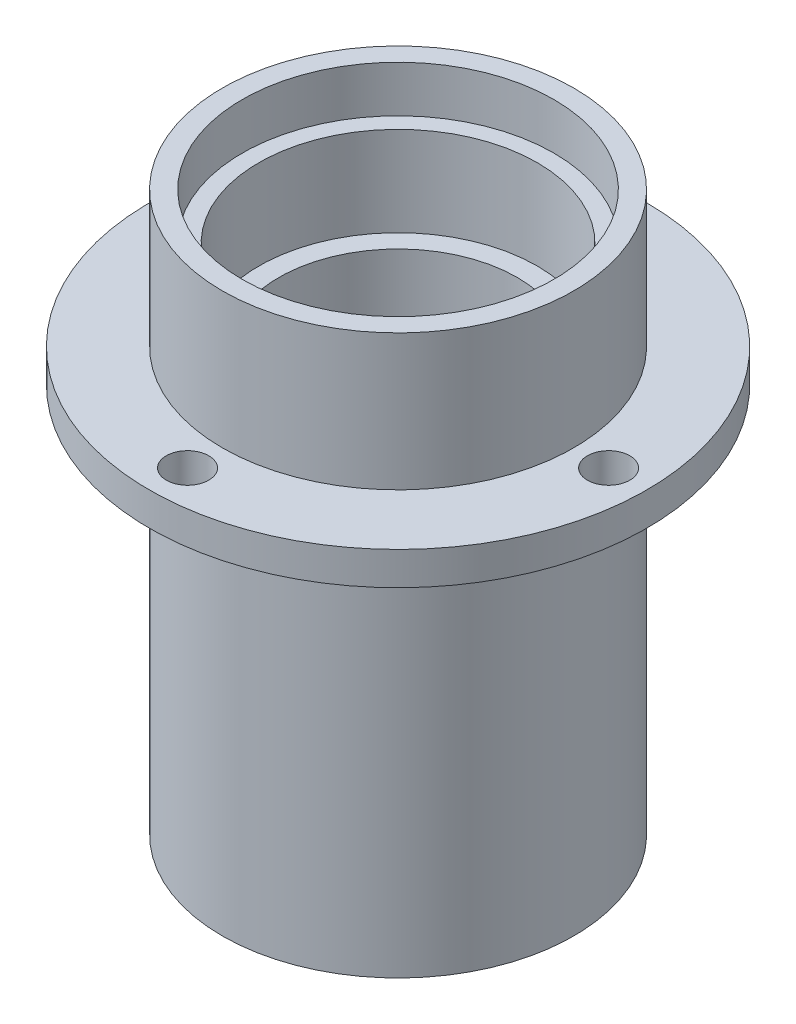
from build123d import *

# Parameters (mm, degrees)
ESQUISSE2_R       = 3.2
PASSAGE_VIS_DEPTH = 10


with BuildPart() as part:
    # Esquisse1 → R_volution1 (revolve)
    with BuildSketch(Plane(origin=(0, 0, 0), x_dir=(0, 0, -1), z_dir=(1, 0, 0))):
        Polygon((23.5, 84.25), (23.5, 77.25), (21, 77.25), (21, 63.75), (18, 63.75), (18, 20.5), (21, 20.5), (21, 7), (23.5, 7), (23.5, 0), (26.5, 0), (26.5, 58.75), (37.5, 58.75), (37.5, 63.75), (26.5, 63.75), (26.5, 84.25), align=None)
    revolve(axis=Axis((0, -31.915042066, 0), (0, 1, 0)))

    # Esquisse2 → passage vis (cut)
    with BuildSketch(Plane(origin=(0, 63.75, 0), x_dir=(-1, 0, 0), z_dir=(0, 1, 0))):
        with Locations(Location((-31.75, 0, 0), (0, 0, 90))):
            Circle(ESQUISSE2_R)
        with Locations(Location((0, 31.75, 0), (0, 0, 90))):
            Circle(ESQUISSE2_R)
        with Locations(Location((31.75, 0, 0), (0, 0, 90))):
            Circle(ESQUISSE2_R)
        with Locations(Location((0, -31.75, 0), (0, 0, 90))):
            Circle(ESQUISSE2_R)
    extrude(amount=-PASSAGE_VIS_DEPTH, mode=Mode.SUBTRACT)


solid = part.part
